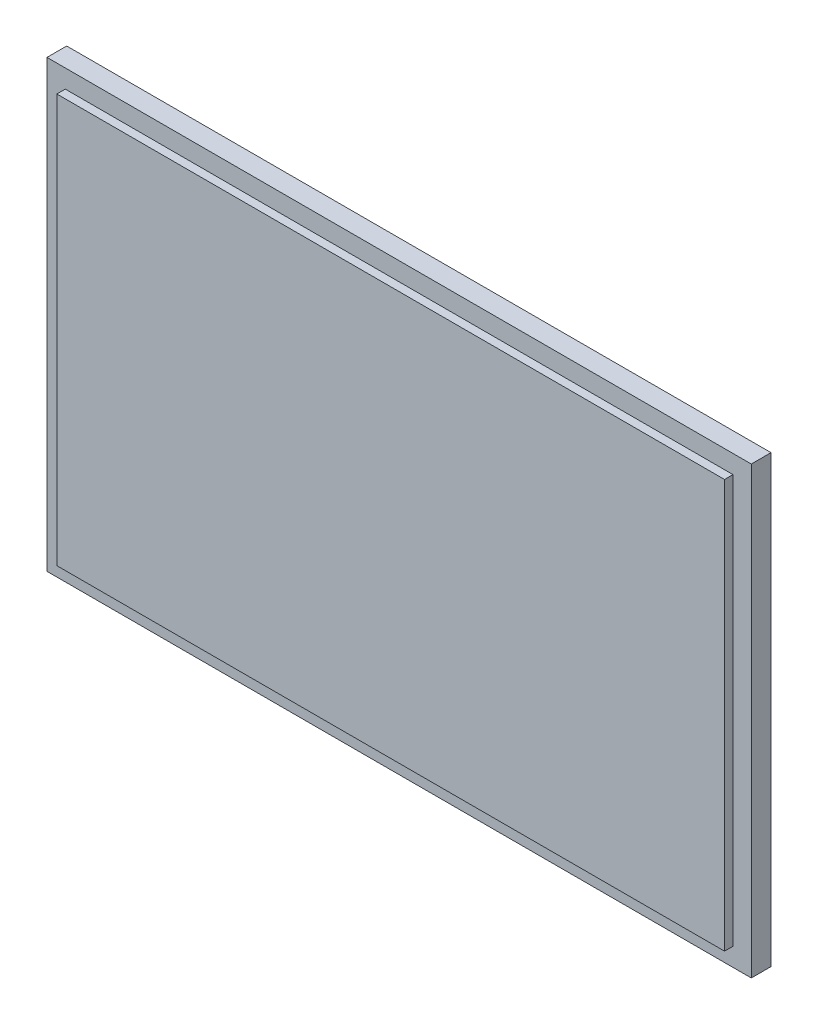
ISO-10303-21;
HEADER;
FILE_DESCRIPTION(('STEP AP214'),'2;1');
FILE_NAME('part.step','',(''),(''),'','','');
FILE_SCHEMA(('AUTOMOTIVE_DESIGN { 1 0 10303 214 1 1 1 1 }'));
ENDSEC;
DATA;
#1=APPLICATION_CONTEXT('core data for automotive mechanical design processes');
#2=APPLICATION_PROTOCOL_DEFINITION('international standard','automotive_design',2000,#1);
#3=PRODUCT_CONTEXT('',#1,'mechanical');
#4=PRODUCT('Part','Part','',(#3));
#5=PRODUCT_RELATED_PRODUCT_CATEGORY('part','',(#4));
#6=PRODUCT_DEFINITION_FORMATION('','',#4);
#7=PRODUCT_DEFINITION_CONTEXT('part definition',#1,'design');
#8=PRODUCT_DEFINITION('design','',#6,#7);
#9=PRODUCT_DEFINITION_SHAPE('','',#8);
#10=(LENGTH_UNIT() NAMED_UNIT(*) SI_UNIT(.MILLI.,.METRE.));
#11=(NAMED_UNIT(*) PLANE_ANGLE_UNIT() SI_UNIT($,.RADIAN.));
#12=(NAMED_UNIT(*) SI_UNIT($,.STERADIAN.) SOLID_ANGLE_UNIT());
#13=UNCERTAINTY_MEASURE_WITH_UNIT(LENGTH_MEASURE(1.E-05),#10,'distance_accuracy_value','');
#14=(GEOMETRIC_REPRESENTATION_CONTEXT(3) GLOBAL_UNCERTAINTY_ASSIGNED_CONTEXT((#13)) GLOBAL_UNIT_ASSIGNED_CONTEXT((#10,
#11,#12)) REPRESENTATION_CONTEXT('',''));
#15=CARTESIAN_POINT('',(0.,0.,0.));
#16=DIRECTION('',(0.,0.,1.));
#17=DIRECTION('',(1.,0.,0.));
#18=AXIS2_PLACEMENT_3D('',#15,#16,#17);
#19=CARTESIAN_POINT('',(-98.7407657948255,66.9982566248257,10.));
#20=DIRECTION('',(1.,0.,0.));
#21=DIRECTION('',(0.,0.,-1.));
#22=AXIS2_PLACEMENT_3D('',#19,#20,#21);
#23=PLANE('',#22);
#24=DIRECTION('',(0.,0.,-1.));
#25=VECTOR('',#24,1.);
#26=CARTESIAN_POINT('',(-98.7407657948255,-91.0017433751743,10.));
#27=LINE('',#26,#25);
#28=CARTESIAN_POINT('',(-98.7407657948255,-91.0017433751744,7.));
#29=VERTEX_POINT('',#28);
#30=CARTESIAN_POINT('',(-98.7407657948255,-91.0017433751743,0.));
#31=VERTEX_POINT('',#30);
#32=EDGE_CURVE('E11',#29,#31,#27,.T.);
#33=ORIENTED_EDGE('',*,*,#32,.F.);
#34=DIRECTION('',(0.,-1.,0.));
#35=VECTOR('',#34,1.);
#36=CARTESIAN_POINT('',(-98.7407657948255,66.9982566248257,7.));
#37=LINE('',#36,#35);
#38=CARTESIAN_POINT('',(-98.7407657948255,66.9982566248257,7.));
#39=VERTEX_POINT('',#38);
#40=EDGE_CURVE('E117',#39,#29,#37,.T.);
#41=ORIENTED_EDGE('',*,*,#40,.F.);
#42=DIRECTION('',(0.,0.,-1.));
#43=VECTOR('',#42,1.);
#44=CARTESIAN_POINT('',(-98.7407657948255,66.9982566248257,10.));
#45=LINE('',#44,#43);
#46=CARTESIAN_POINT('',(-98.7407657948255,66.9982566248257,0.));
#47=VERTEX_POINT('',#46);
#48=EDGE_CURVE('E52',#39,#47,#45,.T.);
#49=ORIENTED_EDGE('',*,*,#48,.T.);
#50=DIRECTION('',(0.,-1.,0.));
#51=VECTOR('',#50,1.);
#52=CARTESIAN_POINT('',(-98.7407657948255,66.9982566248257,0.));
#53=LINE('',#52,#51);
#54=EDGE_CURVE('E125',#47,#31,#53,.T.);
#55=ORIENTED_EDGE('',*,*,#54,.T.);
#56=EDGE_LOOP('',(#33,#41,#49,#55));
#57=FACE_BOUND('',#56,.T.);
#58=ADVANCED_FACE('F30',(#57),#23,.F.);
#59=CARTESIAN_POINT('',(-98.7407657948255,-91.0017433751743,10.));
#60=DIRECTION('',(0.,1.,0.));
#61=DIRECTION('',(0.,0.,1.));
#62=AXIS2_PLACEMENT_3D('',#59,#60,#61);
#63=PLANE('',#62);
#64=DIRECTION('',(1.,0.,0.));
#65=VECTOR('',#64,1.);
#66=CARTESIAN_POINT('',(151.259234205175,-91.0017433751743,7.));
#67=LINE('',#66,#65);
#68=CARTESIAN_POINT('',(151.259234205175,-91.0017433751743,7.));
#69=VERTEX_POINT('',#68);
#70=EDGE_CURVE('E127',#29,#69,#67,.T.);
#71=ORIENTED_EDGE('',*,*,#70,.F.);
#72=ORIENTED_EDGE('',*,*,#32,.T.);
#73=DIRECTION('',(1.,0.,0.));
#74=VECTOR('',#73,1.);
#75=CARTESIAN_POINT('',(-98.7407657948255,-91.0017433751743,0.));
#76=LINE('',#75,#74);
#77=CARTESIAN_POINT('',(151.259234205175,-91.0017433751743,0.));
#78=VERTEX_POINT('',#77);
#79=EDGE_CURVE('E129',#31,#78,#76,.T.);
#80=ORIENTED_EDGE('',*,*,#79,.T.);
#81=DIRECTION('',(0.,0.,-1.));
#82=VECTOR('',#81,1.);
#83=CARTESIAN_POINT('',(151.259234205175,-91.0017433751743,10.));
#84=LINE('',#83,#82);
#85=EDGE_CURVE('E37',#69,#78,#84,.T.);
#86=ORIENTED_EDGE('',*,*,#85,.F.);
#87=EDGE_LOOP('',(#71,#72,#80,#86));
#88=FACE_BOUND('',#87,.T.);
#89=ADVANCED_FACE('F149',(#88),#63,.F.);
#90=CARTESIAN_POINT('',(-98.7407657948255,66.9982566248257,10.));
#91=DIRECTION('',(0.,-1.,0.));
#92=DIRECTION('',(0.,0.,-1.));
#93=AXIS2_PLACEMENT_3D('',#90,#91,#92);
#94=PLANE('',#93);
#95=DIRECTION('',(-1.,0.,0.));
#96=VECTOR('',#95,1.);
#97=CARTESIAN_POINT('',(-98.7407657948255,66.9982566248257,7.));
#98=LINE('',#97,#96);
#99=CARTESIAN_POINT('',(151.259234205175,66.9982566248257,7.));
#100=VERTEX_POINT('',#99);
#101=EDGE_CURVE('E119',#100,#39,#98,.T.);
#102=ORIENTED_EDGE('',*,*,#101,.F.);
#103=DIRECTION('',(0.,0.,-1.));
#104=VECTOR('',#103,1.);
#105=CARTESIAN_POINT('',(151.259234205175,66.9982566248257,10.));
#106=LINE('',#105,#104);
#107=CARTESIAN_POINT('',(151.259234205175,66.9982566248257,0.));
#108=VERTEX_POINT('',#107);
#109=EDGE_CURVE('E138',#100,#108,#106,.T.);
#110=ORIENTED_EDGE('',*,*,#109,.T.);
#111=DIRECTION('',(-1.,0.,0.));
#112=VECTOR('',#111,1.);
#113=CARTESIAN_POINT('',(-98.7407657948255,66.9982566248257,0.));
#114=LINE('',#113,#112);
#115=EDGE_CURVE('E135',#108,#47,#114,.T.);
#116=ORIENTED_EDGE('',*,*,#115,.T.);
#117=ORIENTED_EDGE('',*,*,#48,.F.);
#118=EDGE_LOOP('',(#102,#110,#116,#117));
#119=FACE_BOUND('',#118,.T.);
#120=ADVANCED_FACE('F156',(#119),#94,.F.);
#121=CARTESIAN_POINT('',(151.259234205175,66.9982566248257,10.));
#122=DIRECTION('',(-1.,0.,0.));
#123=DIRECTION('',(0.,0.,1.));
#124=AXIS2_PLACEMENT_3D('',#121,#122,#123);
#125=PLANE('',#124);
#126=DIRECTION('',(0.,1.,0.));
#127=VECTOR('',#126,1.);
#128=CARTESIAN_POINT('',(151.259234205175,66.9982566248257,7.));
#129=LINE('',#128,#127);
#130=EDGE_CURVE('E116',#69,#100,#129,.T.);
#131=ORIENTED_EDGE('',*,*,#130,.F.);
#132=ORIENTED_EDGE('',*,*,#85,.T.);
#133=DIRECTION('',(0.,1.,0.));
#134=VECTOR('',#133,1.);
#135=CARTESIAN_POINT('',(151.259234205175,66.9982566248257,0.));
#136=LINE('',#135,#134);
#137=EDGE_CURVE('E132',#78,#108,#136,.T.);
#138=ORIENTED_EDGE('',*,*,#137,.T.);
#139=ORIENTED_EDGE('',*,*,#109,.F.);
#140=EDGE_LOOP('',(#131,#132,#138,#139));
#141=FACE_BOUND('',#140,.T.);
#142=ADVANCED_FACE('F141',(#141),#125,.F.);
#143=CARTESIAN_POINT('',(-98.7407657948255,-91.0017433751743,10.));
#144=DIRECTION('',(0.,0.,1.));
#145=DIRECTION('',(1.,0.,0.));
#146=AXIS2_PLACEMENT_3D('',#143,#144,#145);
#147=PLANE('',#146);
#148=DIRECTION('',(0.,-1.,0.));
#149=VECTOR('',#148,1.);
#150=CARTESIAN_POINT('',(144.759234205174,60.4982566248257,10.));
#151=LINE('',#150,#149);
#152=CARTESIAN_POINT('',(144.759234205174,60.4982566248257,10.));
#153=VERTEX_POINT('',#152);
#154=CARTESIAN_POINT('',(144.759234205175,-84.5017433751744,10.));
#155=VERTEX_POINT('',#154);
#156=EDGE_CURVE('E100',#153,#155,#151,.T.);
#157=ORIENTED_EDGE('',*,*,#156,.F.);
#158=DIRECTION('',(1.,0.,0.));
#159=VECTOR('',#158,1.);
#160=CARTESIAN_POINT('',(-98.7407657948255,60.4982566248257,10.));
#161=LINE('',#160,#159);
#162=CARTESIAN_POINT('',(-92.2407657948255,60.4982566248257,10.));
#163=VERTEX_POINT('',#162);
#164=EDGE_CURVE('E109',#163,#153,#161,.T.);
#165=ORIENTED_EDGE('',*,*,#164,.F.);
#166=DIRECTION('',(0.,1.,0.));
#167=VECTOR('',#166,1.);
#168=CARTESIAN_POINT('',(-92.2407657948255,60.4982566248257,10.));
#169=LINE('',#168,#167);
#170=CARTESIAN_POINT('',(-92.2407657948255,-84.5017433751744,10.));
#171=VERTEX_POINT('',#170);
#172=EDGE_CURVE('E257',#171,#163,#169,.T.);
#173=ORIENTED_EDGE('',*,*,#172,.F.);
#174=DIRECTION('',(-1.,0.,0.));
#175=VECTOR('',#174,1.);
#176=CARTESIAN_POINT('',(151.259234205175,-84.5017433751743,10.));
#177=LINE('',#176,#175);
#178=EDGE_CURVE('E263',#155,#171,#177,.T.);
#179=ORIENTED_EDGE('',*,*,#178,.F.);
#180=EDGE_LOOP('',(#157,#165,#173,#179));
#181=FACE_BOUND('',#180,.T.);
#182=ADVANCED_FACE('F167',(#181),#147,.T.);
#183=CARTESIAN_POINT('',(-98.7407657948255,-91.0017433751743,0.));
#184=DIRECTION('',(0.,0.,1.));
#185=DIRECTION('',(1.,0.,0.));
#186=AXIS2_PLACEMENT_3D('',#183,#184,#185);
#187=PLANE('',#186);
#188=ORIENTED_EDGE('',*,*,#54,.F.);
#189=ORIENTED_EDGE('',*,*,#115,.F.);
#190=ORIENTED_EDGE('',*,*,#137,.F.);
#191=ORIENTED_EDGE('',*,*,#79,.F.);
#192=EDGE_LOOP('',(#188,#189,#190,#191));
#193=FACE_BOUND('',#192,.T.);
#194=ADVANCED_FACE('F153',(#193),#187,.F.);
#195=CARTESIAN_POINT('',(-98.7407657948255,60.4982566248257,7.));
#196=DIRECTION('',(0.,-1.,0.));
#197=DIRECTION('',(1.,0.,0.));
#198=AXIS2_PLACEMENT_3D('',#195,#196,#197);
#199=PLANE('',#198);
#200=ORIENTED_EDGE('',*,*,#164,.T.);
#201=DIRECTION('',(0.,0.,1.));
#202=VECTOR('',#201,1.);
#203=CARTESIAN_POINT('',(144.759234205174,60.4982566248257,7.));
#204=LINE('',#203,#202);
#205=CARTESIAN_POINT('',(144.759234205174,60.4982566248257,7.));
#206=VERTEX_POINT('',#205);
#207=EDGE_CURVE('E95',#206,#153,#204,.T.);
#208=ORIENTED_EDGE('',*,*,#207,.F.);
#209=DIRECTION('',(1.,0.,0.));
#210=VECTOR('',#209,1.);
#211=CARTESIAN_POINT('',(-98.7407657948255,60.4982566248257,7.));
#212=LINE('',#211,#210);
#213=CARTESIAN_POINT('',(-92.2407657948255,60.4982566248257,7.));
#214=VERTEX_POINT('',#213);
#215=EDGE_CURVE('E107',#214,#206,#212,.T.);
#216=ORIENTED_EDGE('',*,*,#215,.F.);
#217=DIRECTION('',(0.,0.,1.));
#218=VECTOR('',#217,1.);
#219=CARTESIAN_POINT('',(-92.2407657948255,60.4982566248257,7.));
#220=LINE('',#219,#218);
#221=EDGE_CURVE('E258',#214,#163,#220,.T.);
#222=ORIENTED_EDGE('',*,*,#221,.T.);
#223=EDGE_LOOP('',(#200,#208,#216,#222));
#224=FACE_BOUND('',#223,.T.);
#225=ADVANCED_FACE('F105',(#224),#199,.F.);
#226=CARTESIAN_POINT('',(-98.7407657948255,60.4982566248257,7.));
#227=DIRECTION('',(0.,0.,1.));
#228=DIRECTION('',(1.,0.,0.));
#229=AXIS2_PLACEMENT_3D('',#226,#227,#228);
#230=PLANE('',#229);
#231=ORIENTED_EDGE('',*,*,#215,.T.);
#232=DIRECTION('',(0.,-1.,0.));
#233=VECTOR('',#232,1.);
#234=CARTESIAN_POINT('',(144.759234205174,60.4982566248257,7.));
#235=LINE('',#234,#233);
#236=CARTESIAN_POINT('',(144.759234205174,-84.5017433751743,7.));
#237=VERTEX_POINT('',#236);
#238=EDGE_CURVE('E44',#206,#237,#235,.T.);
#239=ORIENTED_EDGE('',*,*,#238,.T.);
#240=DIRECTION('',(-1.,0.,0.));
#241=VECTOR('',#240,1.);
#242=CARTESIAN_POINT('',(151.259234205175,-84.5017433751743,7.));
#243=LINE('',#242,#241);
#244=CARTESIAN_POINT('',(-92.2407657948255,-84.5017433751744,7.));
#245=VERTEX_POINT('',#244);
#246=EDGE_CURVE('E270',#237,#245,#243,.T.);
#247=ORIENTED_EDGE('',*,*,#246,.T.);
#248=DIRECTION('',(0.,1.,0.));
#249=VECTOR('',#248,1.);
#250=CARTESIAN_POINT('',(-92.2407657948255,60.4982566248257,7.));
#251=LINE('',#250,#249);
#252=EDGE_CURVE('E115',#245,#214,#251,.T.);
#253=ORIENTED_EDGE('',*,*,#252,.T.);
#254=EDGE_LOOP('',(#231,#239,#247,#253));
#255=FACE_BOUND('',#254,.T.);
#256=ORIENTED_EDGE('',*,*,#40,.T.);
#257=ORIENTED_EDGE('',*,*,#70,.T.);
#258=ORIENTED_EDGE('',*,*,#130,.T.);
#259=ORIENTED_EDGE('',*,*,#101,.T.);
#260=EDGE_LOOP('',(#256,#257,#258,#259));
#261=FACE_BOUND('',#260,.T.);
#262=ADVANCED_FACE('F112',(#255,#261),#230,.T.);
#263=CARTESIAN_POINT('',(151.259234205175,-84.5017433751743,7.));
#264=DIRECTION('',(0.,1.,0.));
#265=DIRECTION('',(-1.,0.,0.));
#266=AXIS2_PLACEMENT_3D('',#263,#264,#265);
#267=PLANE('',#266);
#268=ORIENTED_EDGE('',*,*,#246,.F.);
#269=DIRECTION('',(0.,0.,1.));
#270=VECTOR('',#269,1.);
#271=CARTESIAN_POINT('',(144.759234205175,-84.5017433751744,7.));
#272=LINE('',#271,#270);
#273=EDGE_CURVE('E98',#237,#155,#272,.T.);
#274=ORIENTED_EDGE('',*,*,#273,.T.);
#275=ORIENTED_EDGE('',*,*,#178,.T.);
#276=DIRECTION('',(0.,0.,1.));
#277=VECTOR('',#276,1.);
#278=CARTESIAN_POINT('',(-92.2407657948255,-84.5017433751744,7.));
#279=LINE('',#278,#277);
#280=EDGE_CURVE('E260',#245,#171,#279,.T.);
#281=ORIENTED_EDGE('',*,*,#280,.F.);
#282=EDGE_LOOP('',(#268,#274,#275,#281));
#283=FACE_BOUND('',#282,.T.);
#284=ADVANCED_FACE('F178',(#283),#267,.F.);
#285=CARTESIAN_POINT('',(-92.2407657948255,60.4982566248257,7.));
#286=DIRECTION('',(1.,0.,0.));
#287=DIRECTION('',(0.,1.,0.));
#288=AXIS2_PLACEMENT_3D('',#285,#286,#287);
#289=PLANE('',#288);
#290=ORIENTED_EDGE('',*,*,#172,.T.);
#291=ORIENTED_EDGE('',*,*,#221,.F.);
#292=ORIENTED_EDGE('',*,*,#252,.F.);
#293=ORIENTED_EDGE('',*,*,#280,.T.);
#294=EDGE_LOOP('',(#290,#291,#292,#293));
#295=FACE_BOUND('',#294,.T.);
#296=ADVANCED_FACE('F181',(#295),#289,.F.);
#297=CARTESIAN_POINT('',(144.759234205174,60.4982566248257,7.));
#298=DIRECTION('',(-1.,0.,0.));
#299=DIRECTION('',(0.,-1.,0.));
#300=AXIS2_PLACEMENT_3D('',#297,#298,#299);
#301=PLANE('',#300);
#302=ORIENTED_EDGE('',*,*,#156,.T.);
#303=ORIENTED_EDGE('',*,*,#273,.F.);
#304=ORIENTED_EDGE('',*,*,#238,.F.);
#305=ORIENTED_EDGE('',*,*,#207,.T.);
#306=EDGE_LOOP('',(#302,#303,#304,#305));
#307=FACE_BOUND('',#306,.T.);
#308=ADVANCED_FACE('F94',(#307),#301,.F.);
#309=CLOSED_SHELL('',(#58,#89,#120,#142,#182,#194,#225,#262,#284,#296,#308));
#310=MANIFOLD_SOLID_BREP('B2',#309);
#311=ADVANCED_BREP_SHAPE_REPRESENTATION('',(#18,#310),#14);
#312=SHAPE_DEFINITION_REPRESENTATION(#9,#311);
ENDSEC;
END-ISO-10303-21;
